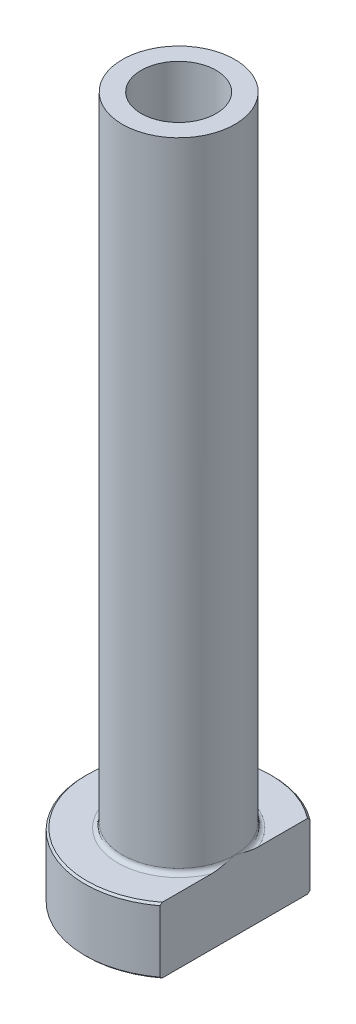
from build123d import *

# Parameters (mm, degrees)
FILLET1_R          = 0.5
CHAMFER1_SIZE      = 0.2
CUT_EXTRUDE1_DEPTH = 77.321687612
CHAMFER2_SIZE      = 0.5


with BuildPart() as part:
    # Sketch1 → Revolve1 (revolve)
    with BuildSketch(Plane.XY, mode=Mode.PRIVATE) as revolve1_sk:
        Polygon((-4, 75), (-6, 75), (-6, 7), (-10, 7), (-10, 0), (-4.25, 0), (-4.25, 18), (-4, 30), align=None)
    revolve(revolve1_sk.sketch.rotate(Axis((0, 92.187680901, 0), (0, -1, 0)), 270), axis=Axis((0, 92.187680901, 0), (0, -1, 0)))

    # Fillet1
    fillet1_edges = [part.edges().sort_by_distance(p)[0] for p in [
        (0, 7, -6),
    ]]
    fillet(fillet1_edges, radius=FILLET1_R)

    # Chamfer1
    chamfer1_edges = [part.edges().sort_by_distance(p)[0] for p in [
        (0, 0, -10),
        (0, 7, -10),
    ]]
    chamfer(chamfer1_edges, length=CHAMFER1_SIZE)

    # Sketch2 → Cut-Extrude1 (cut, through all)
    with BuildSketch(Plane.XZ):
        with BuildLine():
            Line((6, 8), (6, -8))
            ThreePointArc((6, -8), (10, 0), (6, 8))
        make_face()
    extrude(amount=-CUT_EXTRUDE1_DEPTH, mode=Mode.SUBTRACT)

    # Chamfer2
    chamfer2_edges = [part.edges().sort_by_distance(p)[0] for p in [
        (0, 0, -4.25),
    ]]
    chamfer(chamfer2_edges, length=CHAMFER2_SIZE)


solid = part.part
